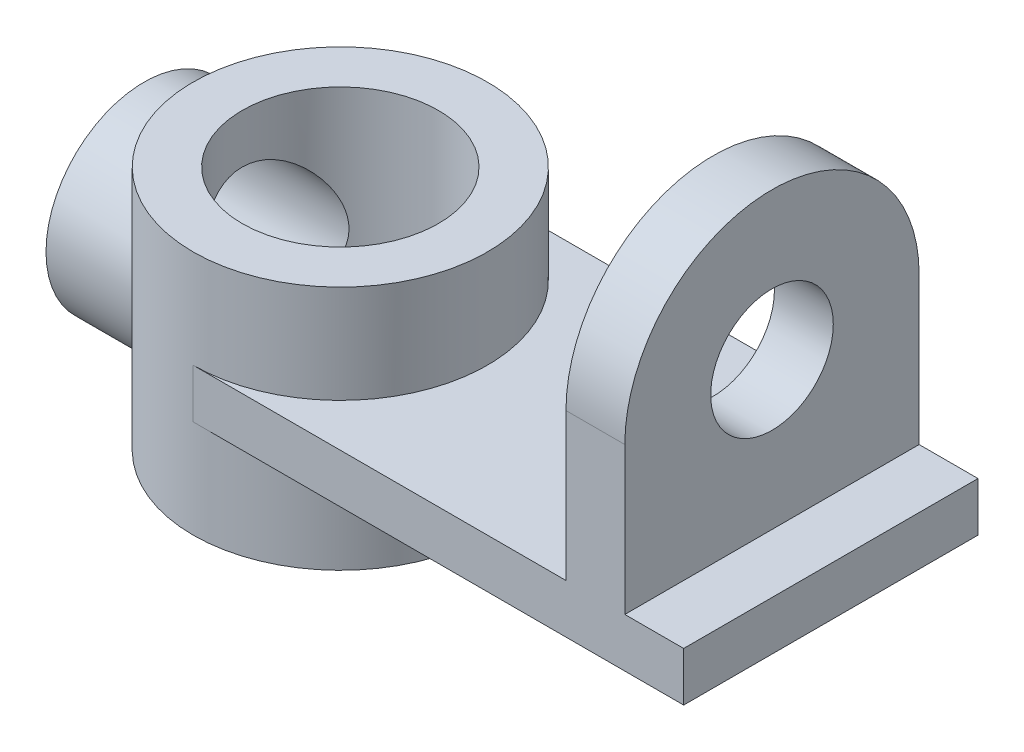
from build123d import *

# Parameters (mm, degrees)
SKETCH_1_W               = 100
SKETCH_1_H               = 60
EXTRUDE_1_DEPTH          = 5
SKETCH_2_R               = 30
EXTRUDE_2_DEPTH          = 25
SKETCH_3_R               = 20
CUT_EXTRUDE_1_DEPTH      = 127.885775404
SKETCH_4_W               = 12
SKETCH_4_H               = 60
EXTRUDE_3_DEPTH          = 60
FILLET_1_RADIUS          = 30
FILLET_1_LENGTH          = 12
CUT_EXTRUDE_2_REACH      = 149.475
SKETCH_5_R               = 12.5
EXTRUDE_4_REACH          = 167.605
EXTRUDE_4_END_RADIUS     = 30
SKETCH_6_R               = 20
CUT_EXTRUDE_3_REACH      = 167.605
CUT_EXTRUDE_3_END_RADIUS = 20
SKETCH_7_R               = 15


with BuildPart() as part:
    # Sketch 1 → Extrude 1 (new, symmetric)
    with BuildSketch(Plane(origin=(0, 0, 0), x_dir=(1, 0, 0), z_dir=(0, 1, 0))):
        with Locations((50, 30)):
            Rectangle(SKETCH_1_W, SKETCH_1_H)
    extrude(amount=EXTRUDE_1_DEPTH, both=True)

    # Sketch 2 → Extrude 2 (add, symmetric)
    with BuildSketch(Plane(origin=(0, 0, 0), x_dir=(1, 0, 0), z_dir=(0, 1, 0))):
        with Locations(Location((0, 30, 0), (0, 0, 270))):
            Circle(SKETCH_2_R)
    extrude(amount=EXTRUDE_2_DEPTH, both=True)

    # Sketch 3 → Cut-Extrude 1 (cut, through all)
    with BuildSketch(Plane(origin=(0, 25, 0), x_dir=(1, 0, 0), z_dir=(0, 1, 0))):
        with Locations(Location((0, 30, 0), (0, 0, 270))):
            Circle(SKETCH_3_R)
    extrude(amount=-CUT_EXTRUDE_1_DEPTH, mode=Mode.SUBTRACT)

    # Sketch 4 → Extrude 3 (add)
    with BuildSketch(Plane(origin=(0, 5, 0), x_dir=(1, 0, 0), z_dir=(0, 1, 0))):
        with Locations((82, 30)):
            Rectangle(SKETCH_4_W, SKETCH_4_H)
    extrude(amount=EXTRUDE_3_DEPTH)

    # Fillet 1: full round fillet: the end face becomes a half cylinder, R = half its width
    fillet_1_face = Plane((82, 65, -30), x_dir=(1, 0, 0), z_dir=(0, 1, 0))  # on the end face: x along it, z out of the body
    fillet_1_slab = fillet_1_face.offset(-FILLET_1_RADIUS / 2) * Box(FILLET_1_LENGTH, 2 * FILLET_1_RADIUS, FILLET_1_RADIUS, mode=Mode.PRIVATE)  # the body's end, R deep
    fillet_1_round = Plane((82, 35, -30), x_dir=(0, 1, 0), z_dir=(1, 0, 0)) * Cylinder(FILLET_1_RADIUS, FILLET_1_LENGTH, mode=Mode.PRIVATE)  # its axis R under the face
    add(fillet_1_slab - fillet_1_round, mode=Mode.SUBTRACT)

    # Sketch 5 → Cut-Extrude 2 (cut, up to next)
    with BuildSketch(Plane(origin=(88, 0, 0), x_dir=(0, 0, -1), z_dir=(1, 0, 0)), mode=Mode.PRIVATE) as cut_extrude_2_sk1:
        with Locations((30, 35)):
            Circle(SKETCH_5_R)
    cut_extrude_2_tool1 = extrude(cut_extrude_2_sk1.sketch, amount=-CUT_EXTRUDE_2_REACH, mode=Mode.PRIVATE) & part.part
    add(cut_extrude_2_tool1.solids().sort_by_distance((88, 35, -30))[0], mode=Mode.SUBTRACT)

    # Extrude 4: up to this cylinder (the profile starts outside it)
    extrude_4_end = Plane(origin=(0, 0, -30), z_dir=(0, -1, 0)) * Cylinder(EXTRUDE_4_END_RADIUS, 396.21, mode=Mode.PRIVATE)
    # Sketch 6 → Extrude 4 (add, up to the surface)
    with BuildSketch(Plane(origin=(-40, 0, 0), x_dir=(0, 0, -1), z_dir=(1, 0, 0)), mode=Mode.PRIVATE) as extrude_4_sk1:
        with Locations(Location((30, 0, 0), (0, 0, 180))):
            Circle(SKETCH_6_R)
    extrude_4_tool1 = extrude(extrude_4_sk1.sketch, amount=EXTRUDE_4_REACH, mode=Mode.PRIVATE) - extrude_4_end
    add(extrude_4_tool1.solids().sort_by_distance((-40, 0, -30))[0])

    # Cut-Extrude 3: up to this cylinder (the profile starts outside it)
    cut_extrude_3_end = Plane(origin=(0, 0, -30), z_dir=(0, 1, 0)) * Cylinder(CUT_EXTRUDE_3_END_RADIUS, 376.21, mode=Mode.PRIVATE)
    # Sketch 7 → Cut-Extrude 3 (cut, up to the surface)
    with BuildSketch(Plane.ZY.offset(40), mode=Mode.PRIVATE) as cut_extrude_3_sk1:
        with Locations((-30, 0)):
            Circle(SKETCH_7_R)
    cut_extrude_3_tool1 = extrude(cut_extrude_3_sk1.sketch, amount=-CUT_EXTRUDE_3_REACH, mode=Mode.PRIVATE) - cut_extrude_3_end
    add(cut_extrude_3_tool1.solids().sort_by_distance((-40, 0, -30))[0], mode=Mode.SUBTRACT)


solid = part.part
